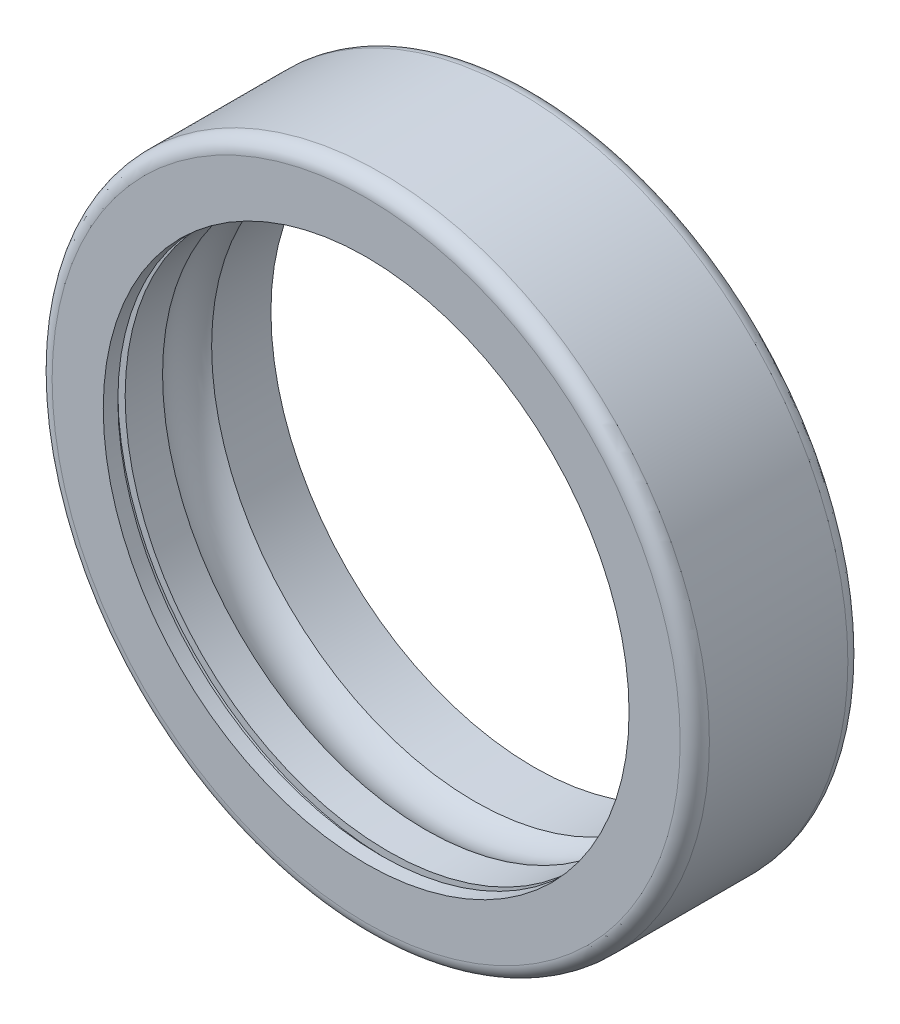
from build123d import *


with BuildPart() as part:
    # Esquisse1 → Base-R_volution (revolve)
    with BuildSketch(Plane(origin=(0, 0, 0), x_dir=(0, 0, -1), z_dir=(1, 0, 0)), mode=Mode.PRIVATE) as base_r_volution_sk:
        with BuildLine():
            Line((-2.37, 11.25), (2.37, 11.25))
            ThreePointArc((2.37, 11.25), (2.723553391, 11.103553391), (2.87, 10.75))
            Line((2.87, 10.75), (2.87, 9))
            Line((2.87, 9), (0.84, 9))
            ThreePointArc((0.84, 9), (0, 9.28), (-0.84, 9))
            Line((-0.84, 9), (-2.12, 9))
            Line((-2.12, 9), (-2.12, 9.25))
            Line((-2.12, 9.25), (-2.37, 9.25))
            Line((-2.37, 9.25), (-2.37, 9))
            Line((-2.37, 9), (-2.87, 9))
            Line((-2.87, 9), (-2.87, 10.75))
            ThreePointArc((-2.87, 10.75), (-2.723553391, 11.103553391), (-2.37, 11.25))
        make_face()
    revolve(base_r_volution_sk.sketch.rotate(Axis((0, 0, 0), (0, 0, 1)), 90), axis=Axis((0, 0, 0), (0, 0, 1)))


solid = part.part
